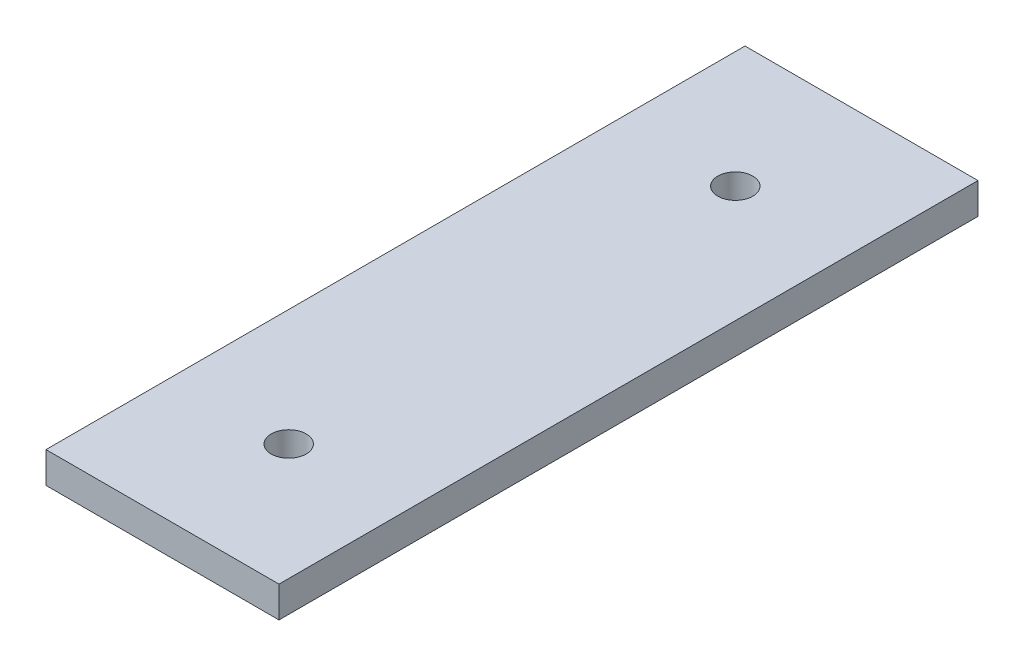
from build123d import *

# Parameters (mm, degrees)
ESQUISSE1_W             = 60
ESQUISSE1_H             = 8
BASE_EXTRUSION_DEPTH    = 180
ESQUISSE2_R             = 4.5
ENL_V_MAT_EXTRU_1_DEPTH = 10


with BuildPart() as part:
    # Esquisse1 → Base-Extrusion (new body)
    with BuildSketch(Plane.XY):
        with Locations((30, -4)):
            Rectangle(ESQUISSE1_W, ESQUISSE1_H)
    extrude(amount=BASE_EXTRUSION_DEPTH)

    # Esquisse2 → Enl_v. mat.-Extru.1 (cut)
    with BuildSketch(Plane(origin=(0, 0, 0), x_dir=(-1, 0, 0), z_dir=(0, 1, 0))):
        with Locations(Location((-30, 147.5, 0), (0, 0, 90))):
            Circle(ESQUISSE2_R)
        with Locations(Location((-30, 32.5, 0), (0, 0, 90))):
            Circle(ESQUISSE2_R)
    extrude(amount=-ENL_V_MAT_EXTRU_1_DEPTH, mode=Mode.SUBTRACT)


solid = part.part
